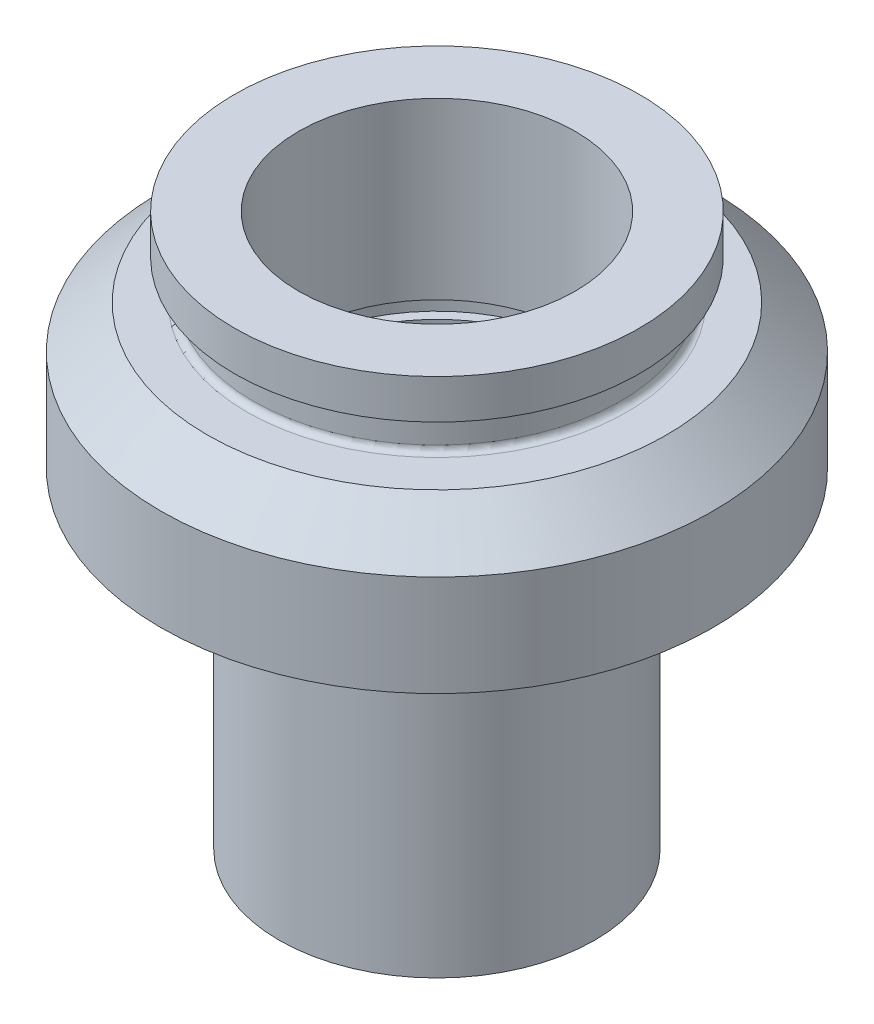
ISO-10303-21;
HEADER;
FILE_DESCRIPTION(('STEP AP214'),'2;1');
FILE_NAME('part.step','',(''),(''),'','','');
FILE_SCHEMA(('AUTOMOTIVE_DESIGN { 1 0 10303 214 1 1 1 1 }'));
ENDSEC;
DATA;
#1=APPLICATION_CONTEXT('core data for automotive mechanical design processes');
#2=APPLICATION_PROTOCOL_DEFINITION('international standard','automotive_design',2000,#1);
#3=PRODUCT_CONTEXT('',#1,'mechanical');
#4=PRODUCT('Part','Part','',(#3));
#5=PRODUCT_RELATED_PRODUCT_CATEGORY('part','',(#4));
#6=PRODUCT_DEFINITION_FORMATION('','',#4);
#7=PRODUCT_DEFINITION_CONTEXT('part definition',#1,'design');
#8=PRODUCT_DEFINITION('design','',#6,#7);
#9=PRODUCT_DEFINITION_SHAPE('','',#8);
#10=(LENGTH_UNIT() NAMED_UNIT(*) SI_UNIT(.MILLI.,.METRE.));
#11=(NAMED_UNIT(*) PLANE_ANGLE_UNIT() SI_UNIT($,.RADIAN.));
#12=(NAMED_UNIT(*) SI_UNIT($,.STERADIAN.) SOLID_ANGLE_UNIT());
#13=UNCERTAINTY_MEASURE_WITH_UNIT(LENGTH_MEASURE(1.E-05),#10,'distance_accuracy_value','');
#14=(GEOMETRIC_REPRESENTATION_CONTEXT(3) GLOBAL_UNCERTAINTY_ASSIGNED_CONTEXT((#13)) GLOBAL_UNIT_ASSIGNED_CONTEXT((#10,
#11,#12)) REPRESENTATION_CONTEXT('',''));
#15=CARTESIAN_POINT('',(0.,0.,0.));
#16=DIRECTION('',(0.,0.,1.));
#17=DIRECTION('',(1.,0.,0.));
#18=AXIS2_PLACEMENT_3D('',#15,#16,#17);
#19=CARTESIAN_POINT('',(0.,2.29933048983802,11.1379));
#20=DIRECTION('',(0.,1.,0.));
#21=DIRECTION('',(0.,0.,1.));
#22=AXIS2_PLACEMENT_3D('',#19,#20,#21);
#23=PLANE('',#22);
#24=CARTESIAN_POINT('',(0.,2.29933048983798,0.));
#25=DIRECTION('',(0.,1.,0.));
#26=DIRECTION('',(0.,0.,1.));
#27=AXIS2_PLACEMENT_3D('',#24,#25,#26);
#28=CIRCLE('',#27,11.1379);
#29=CARTESIAN_POINT('',(0.,2.29933048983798,11.1379));
#30=VERTEX_POINT('',#29);
#31=EDGE_CURVE('E38',#30,#30,#28,.T.);
#32=ORIENTED_EDGE('',*,*,#31,.T.);
#33=EDGE_LOOP('',(#32));
#34=FACE_BOUND('',#33,.T.);
#35=CARTESIAN_POINT('',(0.,2.29933048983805,0.));
#36=DIRECTION('',(0.,1.,0.));
#37=DIRECTION('',(0.,0.,1.));
#38=AXIS2_PLACEMENT_3D('',#35,#36,#37);
#39=CIRCLE('',#38,8.75664999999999);
#40=CARTESIAN_POINT('',(0.,2.29933048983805,8.75664999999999));
#41=VERTEX_POINT('',#40);
#42=EDGE_CURVE('E10',#41,#41,#39,.T.);
#43=ORIENTED_EDGE('',*,*,#42,.F.);
#44=EDGE_LOOP('',(#43));
#45=FACE_BOUND('',#44,.T.);
#46=ADVANCED_FACE('F32',(#34,#45),#23,.T.);
#47=CARTESIAN_POINT('',(0.,21.7993685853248,0.));
#48=DIRECTION('',(0.,1.,0.));
#49=DIRECTION('',(0.,0.,1.));
#50=AXIS2_PLACEMENT_3D('',#47,#48,#49);
#51=CYLINDRICAL_SURFACE('',#50,11.1379);
#52=CARTESIAN_POINT('',(0.,3.64785983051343,0.));
#53=DIRECTION('',(0.,1.,0.));
#54=DIRECTION('',(0.,0.,1.));
#55=AXIS2_PLACEMENT_3D('',#52,#53,#54);
#56=CIRCLE('',#55,11.1379);
#57=CARTESIAN_POINT('',(0.,3.64785983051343,11.1379));
#58=VERTEX_POINT('',#57);
#59=EDGE_CURVE('E42',#58,#58,#56,.T.);
#60=ORIENTED_EDGE('',*,*,#59,.T.);
#61=EDGE_LOOP('',(#60));
#62=FACE_BOUND('',#61,.T.);
#63=ORIENTED_EDGE('',*,*,#31,.F.);
#64=EDGE_LOOP('',(#63));
#65=FACE_BOUND('',#64,.T.);
#66=ADVANCED_FACE('F136',(#62,#65),#51,.F.);
#67=CARTESIAN_POINT('',(0.,3.64785983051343,11.938));
#68=DIRECTION('',(0.,1.,0.));
#69=DIRECTION('',(0.,0.,1.));
#70=AXIS2_PLACEMENT_3D('',#67,#68,#69);
#71=PLANE('',#70);
#72=CARTESIAN_POINT('',(0.,3.64785983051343,0.));
#73=DIRECTION('',(0.,1.,0.));
#74=DIRECTION('',(0.,0.,1.));
#75=AXIS2_PLACEMENT_3D('',#72,#73,#74);
#76=CIRCLE('',#75,11.938);
#77=CARTESIAN_POINT('',(0.,3.64785983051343,11.938));
#78=VERTEX_POINT('',#77);
#79=EDGE_CURVE('E46',#78,#78,#76,.T.);
#80=ORIENTED_EDGE('',*,*,#79,.T.);
#81=EDGE_LOOP('',(#80));
#82=FACE_BOUND('',#81,.T.);
#83=ORIENTED_EDGE('',*,*,#59,.F.);
#84=EDGE_LOOP('',(#83));
#85=FACE_BOUND('',#84,.T.);
#86=ADVANCED_FACE('F140',(#82,#85),#71,.T.);
#87=CARTESIAN_POINT('',(0.,21.7993685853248,0.));
#88=DIRECTION('',(0.,1.,0.));
#89=DIRECTION('',(0.,0.,1.));
#90=AXIS2_PLACEMENT_3D('',#87,#88,#89);
#91=CYLINDRICAL_SURFACE('',#90,11.938);
#92=CARTESIAN_POINT('',(0.,5.01095555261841,0.));
#93=DIRECTION('',(0.,1.,0.));
#94=DIRECTION('',(0.,0.,1.));
#95=AXIS2_PLACEMENT_3D('',#92,#93,#94);
#96=CIRCLE('',#95,11.938);
#97=CARTESIAN_POINT('',(0.,5.01095555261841,11.938));
#98=VERTEX_POINT('',#97);
#99=EDGE_CURVE('E51',#98,#98,#96,.T.);
#100=ORIENTED_EDGE('',*,*,#99,.T.);
#101=EDGE_LOOP('',(#100));
#102=FACE_BOUND('',#101,.T.);
#103=ORIENTED_EDGE('',*,*,#79,.F.);
#104=EDGE_LOOP('',(#103));
#105=FACE_BOUND('',#104,.T.);
#106=ADVANCED_FACE('F146',(#102,#105),#91,.F.);
#107=CARTESIAN_POINT('',(0.,5.01095555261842,11.1379));
#108=DIRECTION('',(0.,-1.,0.));
#109=DIRECTION('',(0.,0.,-1.));
#110=AXIS2_PLACEMENT_3D('',#107,#108,#109);
#111=PLANE('',#110);
#112=CARTESIAN_POINT('',(0.,5.01095555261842,0.));
#113=DIRECTION('',(0.,1.,0.));
#114=DIRECTION('',(0.,0.,1.));
#115=AXIS2_PLACEMENT_3D('',#112,#113,#114);
#116=CIRCLE('',#115,11.1379);
#117=CARTESIAN_POINT('',(0.,5.01095555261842,11.1379));
#118=VERTEX_POINT('',#117);
#119=EDGE_CURVE('E54',#118,#118,#116,.T.);
#120=ORIENTED_EDGE('',*,*,#119,.T.);
#121=EDGE_LOOP('',(#120));
#122=FACE_BOUND('',#121,.T.);
#123=ORIENTED_EDGE('',*,*,#99,.F.);
#124=EDGE_LOOP('',(#123));
#125=FACE_BOUND('',#124,.T.);
#126=ADVANCED_FACE('F153',(#122,#125),#111,.T.);
#127=CARTESIAN_POINT('',(0.,21.7993685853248,0.));
#128=DIRECTION('',(0.,1.,0.));
#129=DIRECTION('',(0.,0.,1.));
#130=AXIS2_PLACEMENT_3D('',#127,#128,#129);
#131=CYLINDRICAL_SURFACE('',#130,11.1379);
#132=CARTESIAN_POINT('',(0.,19.05,0.));
#133=DIRECTION('',(0.,1.,0.));
#134=DIRECTION('',(0.,0.,1.));
#135=AXIS2_PLACEMENT_3D('',#132,#133,#134);
#136=CIRCLE('',#135,11.1379);
#137=CARTESIAN_POINT('',(0.,19.05,11.1379));
#138=VERTEX_POINT('',#137);
#139=EDGE_CURVE('E57',#138,#138,#136,.T.);
#140=ORIENTED_EDGE('',*,*,#139,.T.);
#141=EDGE_LOOP('',(#140));
#142=FACE_BOUND('',#141,.T.);
#143=ORIENTED_EDGE('',*,*,#119,.F.);
#144=EDGE_LOOP('',(#143));
#145=FACE_BOUND('',#144,.T.);
#146=ADVANCED_FACE('F157',(#142,#145),#131,.F.);
#147=CARTESIAN_POINT('',(0.,19.05,16.2946277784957));
#148=DIRECTION('',(0.,1.,0.));
#149=DIRECTION('',(0.,0.,1.));
#150=AXIS2_PLACEMENT_3D('',#147,#148,#149);
#151=PLANE('',#150);
#152=CARTESIAN_POINT('',(0.,19.05,0.));
#153=DIRECTION('',(0.,1.,0.));
#154=DIRECTION('',(0.,0.,1.));
#155=AXIS2_PLACEMENT_3D('',#152,#153,#154);
#156=CIRCLE('',#155,16.2946277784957);
#157=CARTESIAN_POINT('',(0.,19.05,16.2946277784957));
#158=VERTEX_POINT('',#157);
#159=EDGE_CURVE('E60',#158,#158,#156,.T.);
#160=ORIENTED_EDGE('',*,*,#159,.T.);
#161=EDGE_LOOP('',(#160));
#162=FACE_BOUND('',#161,.T.);
#163=ORIENTED_EDGE('',*,*,#139,.F.);
#164=EDGE_LOOP('',(#163));
#165=FACE_BOUND('',#164,.T.);
#166=ADVANCED_FACE('F161',(#162,#165),#151,.T.);
#167=CARTESIAN_POINT('',(0.,21.7993685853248,0.));
#168=DIRECTION('',(0.,1.,0.));
#169=DIRECTION('',(0.,0.,1.));
#170=AXIS2_PLACEMENT_3D('',#167,#168,#169);
#171=CYLINDRICAL_SURFACE('',#170,16.2946277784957);
#172=CARTESIAN_POINT('',(0.,15.875,0.));
#173=DIRECTION('',(0.,1.,0.));
#174=DIRECTION('',(0.,0.,1.));
#175=AXIS2_PLACEMENT_3D('',#172,#173,#174);
#176=CIRCLE('',#175,16.2946277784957);
#177=CARTESIAN_POINT('',(0.,15.875,16.2946277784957));
#178=VERTEX_POINT('',#177);
#179=EDGE_CURVE('E63',#178,#178,#176,.T.);
#180=ORIENTED_EDGE('',*,*,#179,.T.);
#181=EDGE_LOOP('',(#180));
#182=FACE_BOUND('',#181,.T.);
#183=ORIENTED_EDGE('',*,*,#159,.F.);
#184=EDGE_LOOP('',(#183));
#185=FACE_BOUND('',#184,.T.);
#186=ADVANCED_FACE('F165',(#182,#185),#171,.T.);
#187=CARTESIAN_POINT('',(0.,15.875,15.2891626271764));
#188=DIRECTION('',(0.,-1.,0.));
#189=DIRECTION('',(0.,0.,-1.));
#190=AXIS2_PLACEMENT_3D('',#187,#188,#189);
#191=PLANE('',#190);
#192=CARTESIAN_POINT('',(0.,15.875,0.));
#193=DIRECTION('',(0.,1.,0.));
#194=DIRECTION('',(0.,0.,1.));
#195=AXIS2_PLACEMENT_3D('',#192,#193,#194);
#196=CIRCLE('',#195,15.2891626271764);
#197=CARTESIAN_POINT('',(0.,15.875,15.2891626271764));
#198=VERTEX_POINT('',#197);
#199=EDGE_CURVE('E66',#198,#198,#196,.T.);
#200=ORIENTED_EDGE('',*,*,#199,.T.);
#201=EDGE_LOOP('',(#200));
#202=FACE_BOUND('',#201,.T.);
#203=ORIENTED_EDGE('',*,*,#179,.F.);
#204=EDGE_LOOP('',(#203));
#205=FACE_BOUND('',#204,.T.);
#206=ADVANCED_FACE('F169',(#202,#205),#191,.T.);
#207=CARTESIAN_POINT('',(0.,15.367,0.));
#208=DIRECTION('',(0.,1.,0.));
#209=DIRECTION('',(0.,0.,1.));
#210=AXIS2_PLACEMENT_3D('',#207,#208,#209);
#211=TOROIDAL_SURFACE('',#210,15.2891626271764,0.508);
#212=CARTESIAN_POINT('',(0.,15.367,0.));
#213=DIRECTION('',(0.,1.,0.));
#214=DIRECTION('',(0.,0.,1.));
#215=AXIS2_PLACEMENT_3D('',#212,#213,#214);
#216=CIRCLE('',#215,14.7811626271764);
#217=CARTESIAN_POINT('',(0.,15.367,14.7811626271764));
#218=VERTEX_POINT('',#217);
#219=EDGE_CURVE('E69',#218,#218,#216,.T.);
#220=ORIENTED_EDGE('',*,*,#219,.T.);
#221=EDGE_LOOP('',(#220));
#222=FACE_BOUND('',#221,.T.);
#223=ORIENTED_EDGE('',*,*,#199,.F.);
#224=EDGE_LOOP('',(#223));
#225=FACE_BOUND('',#224,.T.);
#226=ADVANCED_FACE('F173',(#222,#225),#211,.F.);
#227=CARTESIAN_POINT('',(0.,21.7993685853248,0.));
#228=DIRECTION('',(0.,1.,0.));
#229=DIRECTION('',(0.,0.,1.));
#230=AXIS2_PLACEMENT_3D('',#227,#228,#229);
#231=CYLINDRICAL_SURFACE('',#230,14.7811626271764);
#232=CARTESIAN_POINT('',(0.,13.208,0.));
#233=DIRECTION('',(0.,1.,0.));
#234=DIRECTION('',(0.,0.,1.));
#235=AXIS2_PLACEMENT_3D('',#232,#233,#234);
#236=CIRCLE('',#235,14.7811626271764);
#237=CARTESIAN_POINT('',(0.,13.208,14.7811626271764));
#238=VERTEX_POINT('',#237);
#239=EDGE_CURVE('E72',#238,#238,#236,.T.);
#240=ORIENTED_EDGE('',*,*,#239,.T.);
#241=EDGE_LOOP('',(#240));
#242=FACE_BOUND('',#241,.T.);
#243=ORIENTED_EDGE('',*,*,#219,.F.);
#244=EDGE_LOOP('',(#243));
#245=FACE_BOUND('',#244,.T.);
#246=ADVANCED_FACE('F177',(#242,#245),#231,.T.);
#247=CARTESIAN_POINT('',(0.,13.208,0.));
#248=DIRECTION('',(0.,1.,0.));
#249=DIRECTION('',(0.,0.,1.));
#250=AXIS2_PLACEMENT_3D('',#247,#248,#249);
#251=TOROIDAL_SURFACE('',#250,15.2891626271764,0.508000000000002);
#252=CARTESIAN_POINT('',(0.,12.7,0.));
#253=DIRECTION('',(0.,1.,0.));
#254=DIRECTION('',(0.,0.,1.));
#255=AXIS2_PLACEMENT_3D('',#252,#253,#254);
#256=CIRCLE('',#255,15.2891626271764);
#257=CARTESIAN_POINT('',(0.,12.7,15.2891626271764));
#258=VERTEX_POINT('',#257);
#259=EDGE_CURVE('E75',#258,#258,#256,.T.);
#260=ORIENTED_EDGE('',*,*,#259,.T.);
#261=EDGE_LOOP('',(#260));
#262=FACE_BOUND('',#261,.T.);
#263=ORIENTED_EDGE('',*,*,#239,.F.);
#264=EDGE_LOOP('',(#263));
#265=FACE_BOUND('',#264,.T.);
#266=ADVANCED_FACE('F181',(#262,#265),#251,.F.);
#267=CARTESIAN_POINT('',(0.,12.7,18.4785));
#268=DIRECTION('',(0.,1.,0.));
#269=DIRECTION('',(0.,0.,1.));
#270=AXIS2_PLACEMENT_3D('',#267,#268,#269);
#271=PLANE('',#270);
#272=CARTESIAN_POINT('',(0.,12.7,0.));
#273=DIRECTION('',(0.,1.,0.));
#274=DIRECTION('',(0.,0.,1.));
#275=AXIS2_PLACEMENT_3D('',#272,#273,#274);
#276=CIRCLE('',#275,18.4785);
#277=CARTESIAN_POINT('',(0.,12.7,18.4785));
#278=VERTEX_POINT('',#277);
#279=EDGE_CURVE('E78',#278,#278,#276,.T.);
#280=ORIENTED_EDGE('',*,*,#279,.T.);
#281=EDGE_LOOP('',(#280));
#282=FACE_BOUND('',#281,.T.);
#283=ORIENTED_EDGE('',*,*,#259,.F.);
#284=EDGE_LOOP('',(#283));
#285=FACE_BOUND('',#284,.T.);
#286=ADVANCED_FACE('F185',(#282,#285),#271,.T.);
#287=CARTESIAN_POINT('',(0.,12.7,0.));
#288=DIRECTION('',(0.,-1.,0.));
#289=DIRECTION('',(0.,0.,-1.));
#290=AXIS2_PLACEMENT_3D('',#287,#288,#289);
#291=CONICAL_SURFACE('',#290,18.4785,0.8296171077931);
#292=CARTESIAN_POINT('',(0.,9.271,0.));
#293=DIRECTION('',(0.,1.,0.));
#294=DIRECTION('',(0.,0.,1.));
#295=AXIS2_PLACEMENT_3D('',#292,#293,#294);
#296=CIRCLE('',#295,22.225);
#297=CARTESIAN_POINT('',(0.,9.271,22.225));
#298=VERTEX_POINT('',#297);
#299=EDGE_CURVE('E81',#298,#298,#296,.T.);
#300=ORIENTED_EDGE('',*,*,#299,.T.);
#301=EDGE_LOOP('',(#300));
#302=FACE_BOUND('',#301,.T.);
#303=ORIENTED_EDGE('',*,*,#279,.F.);
#304=EDGE_LOOP('',(#303));
#305=FACE_BOUND('',#304,.T.);
#306=ADVANCED_FACE('F189',(#302,#305),#291,.T.);
#307=CARTESIAN_POINT('',(0.,21.7993685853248,0.));
#308=DIRECTION('',(0.,1.,0.));
#309=DIRECTION('',(0.,0.,1.));
#310=AXIS2_PLACEMENT_3D('',#307,#308,#309);
#311=CYLINDRICAL_SURFACE('',#310,22.225);
#312=CARTESIAN_POINT('',(0.,1.14966524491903,0.));
#313=DIRECTION('',(0.,1.,0.));
#314=DIRECTION('',(0.,0.,1.));
#315=AXIS2_PLACEMENT_3D('',#312,#313,#314);
#316=CIRCLE('',#315,22.225);
#317=CARTESIAN_POINT('',(0.,1.14966524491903,22.225));
#318=VERTEX_POINT('',#317);
#319=EDGE_CURVE('E84',#318,#318,#316,.T.);
#320=ORIENTED_EDGE('',*,*,#319,.T.);
#321=EDGE_LOOP('',(#320));
#322=FACE_BOUND('',#321,.T.);
#323=ORIENTED_EDGE('',*,*,#299,.F.);
#324=EDGE_LOOP('',(#323));
#325=FACE_BOUND('',#324,.T.);
#326=ADVANCED_FACE('F193',(#322,#325),#311,.T.);
#327=CARTESIAN_POINT('',(0.,1.14966524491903,20.21205));
#328=DIRECTION('',(0.,-1.,0.));
#329=DIRECTION('',(0.,0.,-1.));
#330=AXIS2_PLACEMENT_3D('',#327,#328,#329);
#331=PLANE('',#330);
#332=CARTESIAN_POINT('',(0.,1.14966524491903,0.));
#333=DIRECTION('',(0.,1.,0.));
#334=DIRECTION('',(0.,0.,1.));
#335=AXIS2_PLACEMENT_3D('',#332,#333,#334);
#336=CIRCLE('',#335,20.21205);
#337=CARTESIAN_POINT('',(0.,1.14966524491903,20.21205));
#338=VERTEX_POINT('',#337);
#339=EDGE_CURVE('E87',#338,#338,#336,.T.);
#340=ORIENTED_EDGE('',*,*,#339,.T.);
#341=EDGE_LOOP('',(#340));
#342=FACE_BOUND('',#341,.T.);
#343=ORIENTED_EDGE('',*,*,#319,.F.);
#344=EDGE_LOOP('',(#343));
#345=FACE_BOUND('',#344,.T.);
#346=ADVANCED_FACE('F197',(#342,#345),#331,.T.);
#347=CARTESIAN_POINT('',(0.,21.7993685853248,0.));
#348=DIRECTION('',(0.,1.,0.));
#349=DIRECTION('',(0.,0.,1.));
#350=AXIS2_PLACEMENT_3D('',#347,#348,#349);
#351=CYLINDRICAL_SURFACE('',#350,20.21205);
#352=CARTESIAN_POINT('',(0.,0.,0.));
#353=DIRECTION('',(0.,1.,0.));
#354=DIRECTION('',(0.,0.,1.));
#355=AXIS2_PLACEMENT_3D('',#352,#353,#354);
#356=CIRCLE('',#355,20.21205);
#357=CARTESIAN_POINT('',(0.,0.,20.21205));
#358=VERTEX_POINT('',#357);
#359=EDGE_CURVE('E90',#358,#358,#356,.T.);
#360=ORIENTED_EDGE('',*,*,#359,.T.);
#361=EDGE_LOOP('',(#360));
#362=FACE_BOUND('',#361,.T.);
#363=ORIENTED_EDGE('',*,*,#339,.F.);
#364=EDGE_LOOP('',(#363));
#365=FACE_BOUND('',#364,.T.);
#366=ADVANCED_FACE('F201',(#362,#365),#351,.T.);
#367=CARTESIAN_POINT('',(0.,0.,18.82775));
#368=DIRECTION('',(0.,-1.,0.));
#369=DIRECTION('',(0.,0.,-1.));
#370=AXIS2_PLACEMENT_3D('',#367,#368,#369);
#371=PLANE('',#370);
#372=CARTESIAN_POINT('',(0.,0.,0.));
#373=DIRECTION('',(0.,1.,0.));
#374=DIRECTION('',(0.,0.,1.));
#375=AXIS2_PLACEMENT_3D('',#372,#373,#374);
#376=CIRCLE('',#375,18.82775);
#377=CARTESIAN_POINT('',(0.,0.,18.82775));
#378=VERTEX_POINT('',#377);
#379=EDGE_CURVE('E93',#378,#378,#376,.T.);
#380=ORIENTED_EDGE('',*,*,#379,.T.);
#381=EDGE_LOOP('',(#380));
#382=FACE_BOUND('',#381,.T.);
#383=ORIENTED_EDGE('',*,*,#359,.F.);
#384=EDGE_LOOP('',(#383));
#385=FACE_BOUND('',#384,.T.);
#386=ADVANCED_FACE('F205',(#382,#385),#371,.T.);
#387=CARTESIAN_POINT('',(0.,21.7993685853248,0.));
#388=DIRECTION('',(0.,1.,0.));
#389=DIRECTION('',(0.,0.,1.));
#390=AXIS2_PLACEMENT_3D('',#387,#388,#389);
#391=CYLINDRICAL_SURFACE('',#390,18.82775);
#392=CARTESIAN_POINT('',(0.,2.29933048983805,0.));
#393=DIRECTION('',(0.,1.,0.));
#394=DIRECTION('',(0.,0.,1.));
#395=AXIS2_PLACEMENT_3D('',#392,#393,#394);
#396=CIRCLE('',#395,18.82775);
#397=CARTESIAN_POINT('',(0.,2.29933048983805,18.82775));
#398=VERTEX_POINT('',#397);
#399=EDGE_CURVE('E96',#398,#398,#396,.T.);
#400=ORIENTED_EDGE('',*,*,#399,.T.);
#401=EDGE_LOOP('',(#400));
#402=FACE_BOUND('',#401,.T.);
#403=ORIENTED_EDGE('',*,*,#379,.F.);
#404=EDGE_LOOP('',(#403));
#405=FACE_BOUND('',#404,.T.);
#406=ADVANCED_FACE('F209',(#402,#405),#391,.F.);
#407=CARTESIAN_POINT('',(0.,2.29933048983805,14.99235));
#408=DIRECTION('',(0.,-1.,0.));
#409=DIRECTION('',(0.,0.,-1.));
#410=AXIS2_PLACEMENT_3D('',#407,#408,#409);
#411=PLANE('',#410);
#412=CARTESIAN_POINT('',(0.,2.29933048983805,0.));
#413=DIRECTION('',(0.,1.,0.));
#414=DIRECTION('',(0.,0.,1.));
#415=AXIS2_PLACEMENT_3D('',#412,#413,#414);
#416=CIRCLE('',#415,14.99235);
#417=CARTESIAN_POINT('',(0.,2.29933048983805,14.99235));
#418=VERTEX_POINT('',#417);
#419=EDGE_CURVE('E99',#418,#418,#416,.T.);
#420=ORIENTED_EDGE('',*,*,#419,.T.);
#421=EDGE_LOOP('',(#420));
#422=FACE_BOUND('',#421,.T.);
#423=ORIENTED_EDGE('',*,*,#399,.F.);
#424=EDGE_LOOP('',(#423));
#425=FACE_BOUND('',#424,.T.);
#426=ADVANCED_FACE('F213',(#422,#425),#411,.T.);
#427=CARTESIAN_POINT('',(0.,21.7993685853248,0.));
#428=DIRECTION('',(0.,1.,0.));
#429=DIRECTION('',(0.,0.,1.));
#430=AXIS2_PLACEMENT_3D('',#427,#428,#429);
#431=CYLINDRICAL_SURFACE('',#430,14.99235);
#432=CARTESIAN_POINT('',(0.,0.,0.));
#433=DIRECTION('',(0.,1.,0.));
#434=DIRECTION('',(0.,0.,1.));
#435=AXIS2_PLACEMENT_3D('',#432,#433,#434);
#436=CIRCLE('',#435,14.99235);
#437=CARTESIAN_POINT('',(0.,0.,14.99235));
#438=VERTEX_POINT('',#437);
#439=EDGE_CURVE('E102',#438,#438,#436,.T.);
#440=ORIENTED_EDGE('',*,*,#439,.T.);
#441=EDGE_LOOP('',(#440));
#442=FACE_BOUND('',#441,.T.);
#443=ORIENTED_EDGE('',*,*,#419,.F.);
#444=EDGE_LOOP('',(#443));
#445=FACE_BOUND('',#444,.T.);
#446=ADVANCED_FACE('F217',(#442,#445),#431,.T.);
#447=CARTESIAN_POINT('',(0.,0.,11.66495));
#448=DIRECTION('',(0.,-1.,0.));
#449=DIRECTION('',(0.,0.,-1.));
#450=AXIS2_PLACEMENT_3D('',#447,#448,#449);
#451=PLANE('',#450);
#452=CARTESIAN_POINT('',(0.,0.,0.));
#453=DIRECTION('',(0.,1.,0.));
#454=DIRECTION('',(0.,0.,1.));
#455=AXIS2_PLACEMENT_3D('',#452,#453,#454);
#456=CIRCLE('',#455,11.66495);
#457=CARTESIAN_POINT('',(0.,0.,11.66495));
#458=VERTEX_POINT('',#457);
#459=EDGE_CURVE('E105',#458,#458,#456,.T.);
#460=ORIENTED_EDGE('',*,*,#459,.T.);
#461=EDGE_LOOP('',(#460));
#462=FACE_BOUND('',#461,.T.);
#463=ORIENTED_EDGE('',*,*,#439,.F.);
#464=EDGE_LOOP('',(#463));
#465=FACE_BOUND('',#464,.T.);
#466=ADVANCED_FACE('F221',(#462,#465),#451,.T.);
#467=CARTESIAN_POINT('',(0.,-0.254000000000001,0.));
#468=DIRECTION('',(0.,1.,0.));
#469=DIRECTION('',(0.,0.,1.));
#470=AXIS2_PLACEMENT_3D('',#467,#468,#469);
#471=TOROIDAL_SURFACE('',#470,11.66495,0.254000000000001);
#472=CARTESIAN_POINT('',(0.,-0.254000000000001,0.));
#473=DIRECTION('',(0.,1.,0.));
#474=DIRECTION('',(0.,0.,1.));
#475=AXIS2_PLACEMENT_3D('',#472,#473,#474);
#476=CIRCLE('',#475,11.41095);
#477=CARTESIAN_POINT('',(0.,-0.254000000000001,11.41095));
#478=VERTEX_POINT('',#477);
#479=EDGE_CURVE('E108',#478,#478,#476,.T.);
#480=ORIENTED_EDGE('',*,*,#479,.T.);
#481=EDGE_LOOP('',(#480));
#482=FACE_BOUND('',#481,.T.);
#483=ORIENTED_EDGE('',*,*,#459,.F.);
#484=EDGE_LOOP('',(#483));
#485=FACE_BOUND('',#484,.T.);
#486=ADVANCED_FACE('F225',(#482,#485),#471,.F.);
#487=CARTESIAN_POINT('',(0.,21.7993685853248,0.));
#488=DIRECTION('',(0.,1.,0.));
#489=DIRECTION('',(0.,0.,1.));
#490=AXIS2_PLACEMENT_3D('',#487,#488,#489);
#491=CYLINDRICAL_SURFACE('',#490,11.41095);
#492=CARTESIAN_POINT('',(0.,-3.5179,0.));
#493=DIRECTION('',(0.,1.,0.));
#494=DIRECTION('',(0.,0.,1.));
#495=AXIS2_PLACEMENT_3D('',#492,#493,#494);
#496=CIRCLE('',#495,11.41095);
#497=CARTESIAN_POINT('',(0.,-3.5179,11.41095));
#498=VERTEX_POINT('',#497);
#499=EDGE_CURVE('E111',#498,#498,#496,.T.);
#500=ORIENTED_EDGE('',*,*,#499,.T.);
#501=EDGE_LOOP('',(#500));
#502=FACE_BOUND('',#501,.T.);
#503=ORIENTED_EDGE('',*,*,#479,.F.);
#504=EDGE_LOOP('',(#503));
#505=FACE_BOUND('',#504,.T.);
#506=ADVANCED_FACE('F229',(#502,#505),#491,.T.);
#507=CARTESIAN_POINT('',(0.,-3.5179,12.7));
#508=DIRECTION('',(0.,1.,0.));
#509=DIRECTION('',(0.,0.,1.));
#510=AXIS2_PLACEMENT_3D('',#507,#508,#509);
#511=PLANE('',#510);
#512=CARTESIAN_POINT('',(0.,-3.5179,0.));
#513=DIRECTION('',(0.,1.,0.));
#514=DIRECTION('',(0.,0.,1.));
#515=AXIS2_PLACEMENT_3D('',#512,#513,#514);
#516=CIRCLE('',#515,12.7);
#517=CARTESIAN_POINT('',(0.,-3.5179,12.7));
#518=VERTEX_POINT('',#517);
#519=EDGE_CURVE('E114',#518,#518,#516,.T.);
#520=ORIENTED_EDGE('',*,*,#519,.T.);
#521=EDGE_LOOP('',(#520));
#522=FACE_BOUND('',#521,.T.);
#523=ORIENTED_EDGE('',*,*,#499,.F.);
#524=EDGE_LOOP('',(#523));
#525=FACE_BOUND('',#524,.T.);
#526=ADVANCED_FACE('F233',(#522,#525),#511,.T.);
#527=CARTESIAN_POINT('',(0.,21.7993685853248,0.));
#528=DIRECTION('',(0.,1.,0.));
#529=DIRECTION('',(0.,0.,1.));
#530=AXIS2_PLACEMENT_3D('',#527,#528,#529);
#531=CYLINDRICAL_SURFACE('',#530,12.7);
#532=CARTESIAN_POINT('',(0.,-25.4,0.));
#533=DIRECTION('',(0.,1.,0.));
#534=DIRECTION('',(0.,0.,1.));
#535=AXIS2_PLACEMENT_3D('',#532,#533,#534);
#536=CIRCLE('',#535,12.7);
#537=CARTESIAN_POINT('',(0.,-25.4,12.7));
#538=VERTEX_POINT('',#537);
#539=EDGE_CURVE('E117',#538,#538,#536,.T.);
#540=ORIENTED_EDGE('',*,*,#539,.T.);
#541=EDGE_LOOP('',(#540));
#542=FACE_BOUND('',#541,.T.);
#543=ORIENTED_EDGE('',*,*,#519,.F.);
#544=EDGE_LOOP('',(#543));
#545=FACE_BOUND('',#544,.T.);
#546=ADVANCED_FACE('F133',(#542,#545),#531,.T.);
#547=CARTESIAN_POINT('',(0.,-25.4,12.7));
#548=DIRECTION('',(0.,-1.,0.));
#549=DIRECTION('',(0.,0.,-1.));
#550=AXIS2_PLACEMENT_3D('',#547,#548,#549);
#551=PLANE('',#550);
#552=CARTESIAN_POINT('',(0.,-25.4,0.));
#553=DIRECTION('',(0.,1.,0.));
#554=DIRECTION('',(0.,0.,1.));
#555=AXIS2_PLACEMENT_3D('',#552,#553,#554);
#556=CIRCLE('',#555,8.75664999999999);
#557=CARTESIAN_POINT('',(0.,-25.4,8.75664999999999));
#558=VERTEX_POINT('',#557);
#559=EDGE_CURVE('E120',#558,#558,#556,.T.);
#560=ORIENTED_EDGE('',*,*,#559,.T.);
#561=EDGE_LOOP('',(#560));
#562=FACE_BOUND('',#561,.T.);
#563=ORIENTED_EDGE('',*,*,#539,.F.);
#564=EDGE_LOOP('',(#563));
#565=FACE_BOUND('',#564,.T.);
#566=ADVANCED_FACE('F124',(#562,#565),#551,.T.);
#567=CARTESIAN_POINT('',(0.,21.7993685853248,0.));
#568=DIRECTION('',(0.,1.,0.));
#569=DIRECTION('',(0.,0.,1.));
#570=AXIS2_PLACEMENT_3D('',#567,#568,#569);
#571=CYLINDRICAL_SURFACE('',#570,8.75664999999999);
#572=ORIENTED_EDGE('',*,*,#42,.T.);
#573=EDGE_LOOP('',(#572));
#574=FACE_BOUND('',#573,.T.);
#575=ORIENTED_EDGE('',*,*,#559,.F.);
#576=EDGE_LOOP('',(#575));
#577=FACE_BOUND('',#576,.T.);
#578=ADVANCED_FACE('F127',(#574,#577),#571,.F.);
#579=CLOSED_SHELL('',(#46,#66,#86,#106,#126,#146,#166,#186,#206,#226,#246,#266,#286,#306,#326,
#346,#366,#386,#406,#426,#446,#466,#486,#506,#526,#546,#566,#578));
#580=MANIFOLD_SOLID_BREP('B2',#579);
#581=ADVANCED_BREP_SHAPE_REPRESENTATION('',(#18,#580),#14);
#582=SHAPE_DEFINITION_REPRESENTATION(#9,#581);
ENDSEC;
END-ISO-10303-21;
